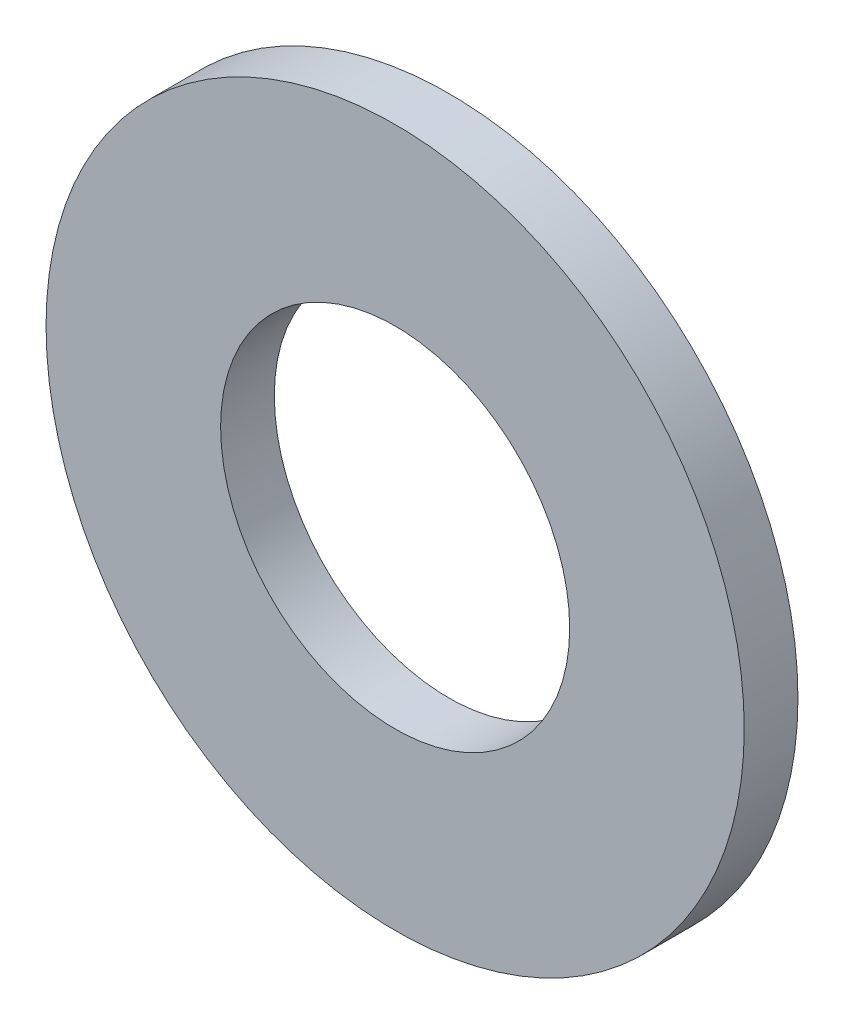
ISO-10303-21;
HEADER;
FILE_DESCRIPTION(('STEP AP214'),'2;1');
FILE_NAME('part.step','',(''),(''),'','','');
FILE_SCHEMA(('AUTOMOTIVE_DESIGN { 1 0 10303 214 1 1 1 1 }'));
ENDSEC;
DATA;
#1=APPLICATION_CONTEXT('core data for automotive mechanical design processes');
#2=APPLICATION_PROTOCOL_DEFINITION('international standard','automotive_design',2000,#1);
#3=PRODUCT_CONTEXT('',#1,'mechanical');
#4=PRODUCT('Part','Part','',(#3));
#5=PRODUCT_RELATED_PRODUCT_CATEGORY('part','',(#4));
#6=PRODUCT_DEFINITION_FORMATION('','',#4);
#7=PRODUCT_DEFINITION_CONTEXT('part definition',#1,'design');
#8=PRODUCT_DEFINITION('design','',#6,#7);
#9=PRODUCT_DEFINITION_SHAPE('','',#8);
#10=(LENGTH_UNIT() NAMED_UNIT(*) SI_UNIT(.MILLI.,.METRE.));
#11=(NAMED_UNIT(*) PLANE_ANGLE_UNIT() SI_UNIT($,.RADIAN.));
#12=(NAMED_UNIT(*) SI_UNIT($,.STERADIAN.) SOLID_ANGLE_UNIT());
#13=UNCERTAINTY_MEASURE_WITH_UNIT(LENGTH_MEASURE(1.E-05),#10,'distance_accuracy_value','');
#14=(GEOMETRIC_REPRESENTATION_CONTEXT(3) GLOBAL_UNCERTAINTY_ASSIGNED_CONTEXT((#13)) GLOBAL_UNIT_ASSIGNED_CONTEXT((#10,
#11,#12)) REPRESENTATION_CONTEXT('',''));
#15=CARTESIAN_POINT('',(0.,0.,0.));
#16=DIRECTION('',(0.,0.,1.));
#17=DIRECTION('',(1.,0.,0.));
#18=AXIS2_PLACEMENT_3D('',#15,#16,#17);
#19=CARTESIAN_POINT('',(0.,0.,1.));
#20=DIRECTION('',(0.,0.,-1.));
#21=DIRECTION('',(-1.,0.,0.));
#22=AXIS2_PLACEMENT_3D('',#19,#20,#21);
#23=CYLINDRICAL_SURFACE('',#22,6.5);
#24=CARTESIAN_POINT('',(0.,0.,1.));
#25=DIRECTION('',(0.,0.,1.));
#26=DIRECTION('',(1.,0.,0.));
#27=AXIS2_PLACEMENT_3D('',#24,#25,#26);
#28=CIRCLE('',#27,6.5);
#29=CARTESIAN_POINT('',(6.50000000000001,0.,1.));
#30=VERTEX_POINT('',#29);
#31=EDGE_CURVE('E10',#30,#30,#28,.T.);
#32=ORIENTED_EDGE('',*,*,#31,.F.);
#33=EDGE_LOOP('',(#32));
#34=FACE_BOUND('',#33,.T.);
#35=CARTESIAN_POINT('',(0.,0.,0.));
#36=DIRECTION('',(0.,0.,1.));
#37=DIRECTION('',(1.,0.,0.));
#38=AXIS2_PLACEMENT_3D('',#35,#36,#37);
#39=CIRCLE('',#38,6.5);
#40=CARTESIAN_POINT('',(6.50000000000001,0.,0.));
#41=VERTEX_POINT('',#40);
#42=EDGE_CURVE('E37',#41,#41,#39,.T.);
#43=ORIENTED_EDGE('',*,*,#42,.T.);
#44=EDGE_LOOP('',(#43));
#45=FACE_BOUND('',#44,.T.);
#46=ADVANCED_FACE('F31',(#34,#45),#23,.T.);
#47=CARTESIAN_POINT('',(0.,0.,1.));
#48=DIRECTION('',(0.,0.,1.));
#49=DIRECTION('',(1.,0.,0.));
#50=AXIS2_PLACEMENT_3D('',#47,#48,#49);
#51=PLANE('',#50);
#52=CARTESIAN_POINT('',(0.,0.,1.));
#53=DIRECTION('',(0.,0.,-1.));
#54=DIRECTION('',(-1.,0.,0.));
#55=AXIS2_PLACEMENT_3D('',#52,#53,#54);
#56=CIRCLE('',#55,3.25);
#57=CARTESIAN_POINT('',(-3.25,0.,1.));
#58=VERTEX_POINT('',#57);
#59=EDGE_CURVE('E41',#58,#58,#56,.T.);
#60=ORIENTED_EDGE('',*,*,#59,.T.);
#61=EDGE_LOOP('',(#60));
#62=FACE_BOUND('',#61,.T.);
#63=ORIENTED_EDGE('',*,*,#31,.T.);
#64=EDGE_LOOP('',(#63));
#65=FACE_BOUND('',#64,.T.);
#66=ADVANCED_FACE('F56',(#62,#65),#51,.T.);
#67=CARTESIAN_POINT('',(0.,0.,0.));
#68=DIRECTION('',(0.,0.,1.));
#69=DIRECTION('',(1.,0.,0.));
#70=AXIS2_PLACEMENT_3D('',#67,#68,#69);
#71=PLANE('',#70);
#72=CARTESIAN_POINT('',(0.,0.,0.));
#73=DIRECTION('',(0.,0.,-1.));
#74=DIRECTION('',(-1.,0.,0.));
#75=AXIS2_PLACEMENT_3D('',#72,#73,#74);
#76=CIRCLE('',#75,3.25);
#77=CARTESIAN_POINT('',(-3.25,0.,0.));
#78=VERTEX_POINT('',#77);
#79=EDGE_CURVE('E45',#78,#78,#76,.T.);
#80=ORIENTED_EDGE('',*,*,#79,.F.);
#81=EDGE_LOOP('',(#80));
#82=FACE_BOUND('',#81,.T.);
#83=ORIENTED_EDGE('',*,*,#42,.F.);
#84=EDGE_LOOP('',(#83));
#85=FACE_BOUND('',#84,.T.);
#86=ADVANCED_FACE('F53',(#82,#85),#71,.F.);
#87=CARTESIAN_POINT('',(0.,0.,1.));
#88=DIRECTION('',(0.,0.,-1.));
#89=DIRECTION('',(-1.,0.,0.));
#90=AXIS2_PLACEMENT_3D('',#87,#88,#89);
#91=CYLINDRICAL_SURFACE('',#90,3.25);
#92=ORIENTED_EDGE('',*,*,#59,.F.);
#93=EDGE_LOOP('',(#92));
#94=FACE_BOUND('',#93,.T.);
#95=ORIENTED_EDGE('',*,*,#79,.T.);
#96=EDGE_LOOP('',(#95));
#97=FACE_BOUND('',#96,.T.);
#98=ADVANCED_FACE('F51',(#94,#97),#91,.F.);
#99=CLOSED_SHELL('',(#46,#66,#86,#98));
#100=MANIFOLD_SOLID_BREP('B2',#99);
#101=ADVANCED_BREP_SHAPE_REPRESENTATION('',(#18,#100),#14);
#102=SHAPE_DEFINITION_REPRESENTATION(#9,#101);
ENDSEC;
END-ISO-10303-21;
